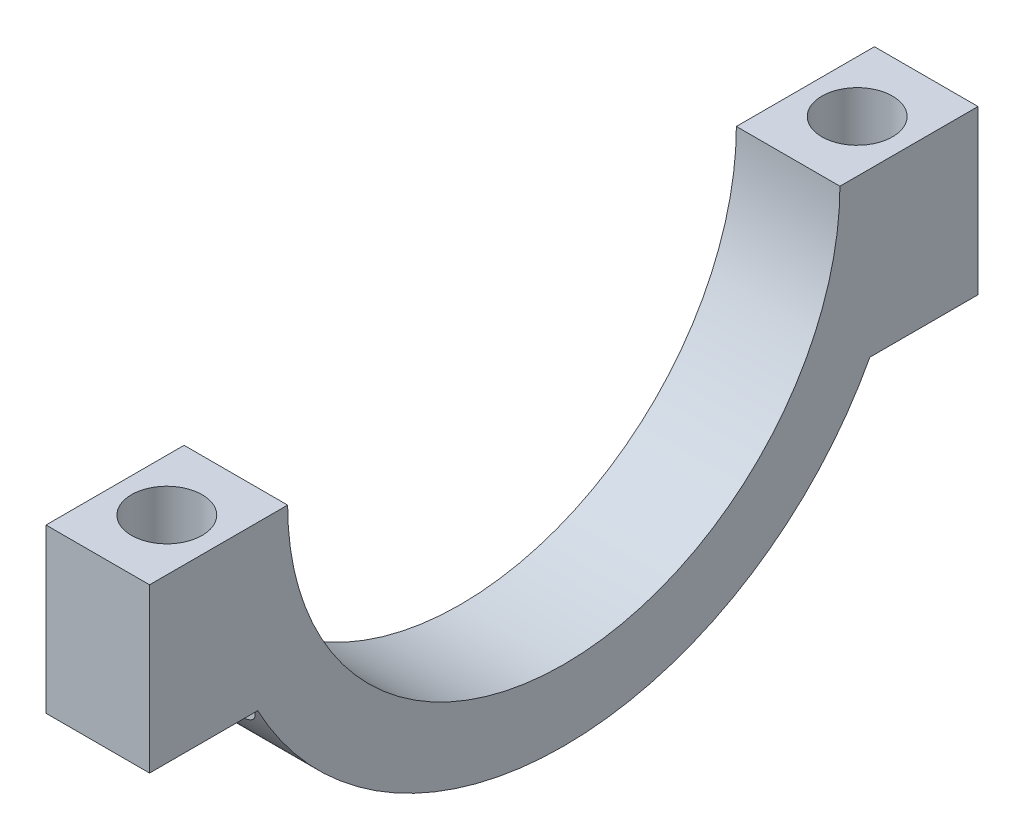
from build123d import *

# Parameters (mm, degrees)
BOSS_EXTRUDE1_DEPTH = 9.525
SKETCH2_R           = 6.5
CUT_EXTRUDE1_DEPTH  = 100.837896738
SKETCH3_R           = 11.5
CUT_EXTRUDE2_DEPTH  = 19.05


with BuildPart() as part:
    # Sketch1 → Boss-Extrude1 (new, symmetric)
    with BuildSketch(Plane(origin=(0, 0, 0), x_dir=(0, 0, -1), z_dir=(1, 0, 0))):
        with BuildLine():
            Line((50.8, 0), (76.2, 0))
            Line((76.2, 0), (76.2, -30))
            Line((76.2, -30), (56.306660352, -30))
            ThreePointArc((56.306660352, -30), (0, -63.8), (-56.306660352, -30))
            Line((-56.306660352, -30), (-76.2, -30))
            Line((-76.2, -30), (-76.2, 0))
            Line((-76.2, 0), (-50.8, 0))
            ThreePointArc((-50.8, 0), (0, -50.8), (50.8, 0))
        make_face()
    extrude(amount=BOSS_EXTRUDE1_DEPTH, both=True)

    # Sketch2 → Cut-Extrude1 (cut, through all)
    with BuildSketch(Plane(origin=(0, 0, 0), x_dir=(1, 0, 0), z_dir=(0, 1, 0))):
        with Locations(Location((0, 63.5, 0), (0, 0, 270))):
            Circle(SKETCH2_R)
        with Locations(Location((0, -63.5, 0), (0, 0, 270))):
            Circle(SKETCH2_R)
    extrude(amount=-CUT_EXTRUDE1_DEPTH, mode=Mode.SUBTRACT)

    # Sketch3 → Cut-Extrude2 (cut)
    with BuildSketch(Plane.XZ.offset(30)):
        with Locations((0, 63.5)):
            Circle(SKETCH3_R)
        with Locations((0, -63.5)):
            Circle(SKETCH3_R)
    extrude(amount=CUT_EXTRUDE2_DEPTH, mode=Mode.SUBTRACT)


solid = part.part
